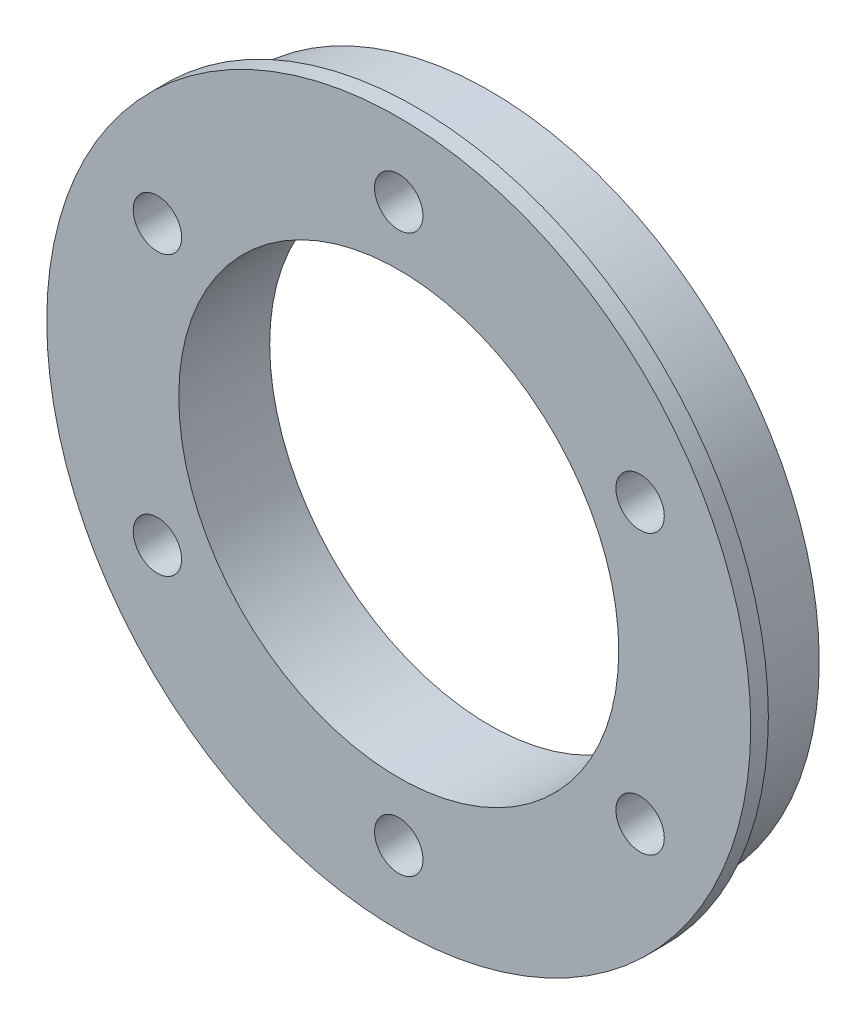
ISO-10303-21;
HEADER;
FILE_DESCRIPTION(('STEP AP214'),'2;1');
FILE_NAME('part.step','',(''),(''),'','','');
FILE_SCHEMA(('AUTOMOTIVE_DESIGN { 1 0 10303 214 1 1 1 1 }'));
ENDSEC;
DATA;
#1=APPLICATION_CONTEXT('core data for automotive mechanical design processes');
#2=APPLICATION_PROTOCOL_DEFINITION('international standard','automotive_design',2000,#1);
#3=PRODUCT_CONTEXT('',#1,'mechanical');
#4=PRODUCT('Part','Part','',(#3));
#5=PRODUCT_RELATED_PRODUCT_CATEGORY('part','',(#4));
#6=PRODUCT_DEFINITION_FORMATION('','',#4);
#7=PRODUCT_DEFINITION_CONTEXT('part definition',#1,'design');
#8=PRODUCT_DEFINITION('design','',#6,#7);
#9=PRODUCT_DEFINITION_SHAPE('','',#8);
#10=(LENGTH_UNIT() NAMED_UNIT(*) SI_UNIT(.MILLI.,.METRE.));
#11=(NAMED_UNIT(*) PLANE_ANGLE_UNIT() SI_UNIT($,.RADIAN.));
#12=(NAMED_UNIT(*) SI_UNIT($,.STERADIAN.) SOLID_ANGLE_UNIT());
#13=UNCERTAINTY_MEASURE_WITH_UNIT(LENGTH_MEASURE(1.E-05),#10,'distance_accuracy_value','');
#14=(GEOMETRIC_REPRESENTATION_CONTEXT(3) GLOBAL_UNCERTAINTY_ASSIGNED_CONTEXT((#13)) GLOBAL_UNIT_ASSIGNED_CONTEXT((#10,
#11,#12)) REPRESENTATION_CONTEXT('',''));
#15=CARTESIAN_POINT('',(0.,0.,0.));
#16=DIRECTION('',(0.,0.,1.));
#17=DIRECTION('',(1.,0.,0.));
#18=AXIS2_PLACEMENT_3D('',#15,#16,#17);
#19=CARTESIAN_POINT('',(0.,0.,5.));
#20=DIRECTION('',(0.,0.,1.));
#21=DIRECTION('',(1.,0.,0.));
#22=AXIS2_PLACEMENT_3D('',#19,#20,#21);
#23=PLANE('',#22);
#24=CARTESIAN_POINT('',(0.,0.,5.));
#25=DIRECTION('',(0.,0.,1.));
#26=DIRECTION('',(1.,0.,0.));
#27=AXIS2_PLACEMENT_3D('',#24,#25,#26);
#28=CIRCLE('',#27,22.47);
#29=CARTESIAN_POINT('',(22.47,0.,5.));
#30=VERTEX_POINT('',#29);
#31=EDGE_CURVE('E22',#30,#30,#28,.T.);
#32=ORIENTED_EDGE('',*,*,#31,.T.);
#33=EDGE_LOOP('',(#32));
#34=FACE_BOUND('',#33,.T.);
#35=CARTESIAN_POINT('',(0.,0.,5.));
#36=DIRECTION('',(0.,0.,1.));
#37=DIRECTION('',(1.,0.,0.));
#38=AXIS2_PLACEMENT_3D('',#35,#36,#37);
#39=CIRCLE('',#38,24.);
#40=CARTESIAN_POINT('',(24.,0.,5.));
#41=VERTEX_POINT('',#40);
#42=EDGE_CURVE('E41',#41,#41,#39,.T.);
#43=ORIENTED_EDGE('',*,*,#42,.F.);
#44=EDGE_LOOP('',(#43));
#45=FACE_BOUND('',#44,.T.);
#46=ADVANCED_FACE('F15',(#34,#45),#23,.F.);
#47=CARTESIAN_POINT('',(0.,0.,6.2));
#48=DIRECTION('',(0.,0.,1.));
#49=DIRECTION('',(1.,0.,0.));
#50=AXIS2_PLACEMENT_3D('',#47,#48,#49);
#51=PLANE('',#50);
#52=CARTESIAN_POINT('',(0.,0.,6.2));
#53=DIRECTION('',(0.,0.,1.));
#54=DIRECTION('',(1.,0.,0.));
#55=AXIS2_PLACEMENT_3D('',#52,#53,#54);
#56=CIRCLE('',#55,15.);
#57=CARTESIAN_POINT('',(15.,0.,6.2));
#58=VERTEX_POINT('',#57);
#59=EDGE_CURVE('E38',#58,#58,#56,.T.);
#60=ORIENTED_EDGE('',*,*,#59,.F.);
#61=EDGE_LOOP('',(#60));
#62=FACE_BOUND('',#61,.T.);
#63=CARTESIAN_POINT('',(-16.4544826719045,9.49999999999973,6.2));
#64=DIRECTION('',(0.,0.,1.));
#65=DIRECTION('',(1.,0.,0.));
#66=AXIS2_PLACEMENT_3D('',#63,#64,#65);
#67=CIRCLE('',#66,1.65);
#68=CARTESIAN_POINT('',(-14.8044826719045,9.49999999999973,6.2));
#69=VERTEX_POINT('',#68);
#70=EDGE_CURVE('E53',#69,#69,#67,.T.);
#71=ORIENTED_EDGE('',*,*,#70,.F.);
#72=EDGE_LOOP('',(#71));
#73=FACE_BOUND('',#72,.T.);
#74=CARTESIAN_POINT('',(-16.4544826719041,-9.50000000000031,6.2));
#75=DIRECTION('',(0.,0.,1.));
#76=DIRECTION('',(1.,0.,0.));
#77=AXIS2_PLACEMENT_3D('',#74,#75,#76);
#78=CIRCLE('',#77,1.65);
#79=CARTESIAN_POINT('',(-14.8044826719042,-9.50000000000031,6.2));
#80=VERTEX_POINT('',#79);
#81=EDGE_CURVE('E58',#80,#80,#78,.T.);
#82=ORIENTED_EDGE('',*,*,#81,.F.);
#83=EDGE_LOOP('',(#82));
#84=FACE_BOUND('',#83,.T.);
#85=CARTESIAN_POINT('',(1.32676290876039E-13,-19.,6.2));
#86=DIRECTION('',(0.,0.,1.));
#87=DIRECTION('',(1.,0.,0.));
#88=AXIS2_PLACEMENT_3D('',#85,#86,#87);
#89=CIRCLE('',#88,1.65);
#90=CARTESIAN_POINT('',(1.65000000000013,-19.,6.2));
#91=VERTEX_POINT('',#90);
#92=EDGE_CURVE('E69',#91,#91,#89,.T.);
#93=ORIENTED_EDGE('',*,*,#92,.F.);
#94=EDGE_LOOP('',(#93));
#95=FACE_BOUND('',#94,.T.);
#96=CARTESIAN_POINT('',(16.4544826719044,-9.49999999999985,6.2));
#97=DIRECTION('',(0.,0.,1.));
#98=DIRECTION('',(1.,0.,0.));
#99=AXIS2_PLACEMENT_3D('',#96,#97,#98);
#100=CIRCLE('',#99,1.65);
#101=CARTESIAN_POINT('',(18.1044826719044,-9.49999999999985,6.2));
#102=VERTEX_POINT('',#101);
#103=EDGE_CURVE('E70',#102,#102,#100,.T.);
#104=ORIENTED_EDGE('',*,*,#103,.F.);
#105=EDGE_LOOP('',(#104));
#106=FACE_BOUND('',#105,.T.);
#107=CARTESIAN_POINT('',(16.4544826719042,9.50000000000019,6.2));
#108=DIRECTION('',(0.,0.,1.));
#109=DIRECTION('',(1.,0.,0.));
#110=AXIS2_PLACEMENT_3D('',#107,#108,#109);
#111=CIRCLE('',#110,1.65);
#112=CARTESIAN_POINT('',(18.1044826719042,9.50000000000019,6.2));
#113=VERTEX_POINT('',#112);
#114=EDGE_CURVE('E79',#113,#113,#111,.T.);
#115=ORIENTED_EDGE('',*,*,#114,.F.);
#116=EDGE_LOOP('',(#115));
#117=FACE_BOUND('',#116,.T.);
#118=CARTESIAN_POINT('',(0.,19.,6.2));
#119=DIRECTION('',(0.,0.,1.));
#120=DIRECTION('',(1.,0.,0.));
#121=AXIS2_PLACEMENT_3D('',#118,#119,#120);
#122=CIRCLE('',#121,1.65);
#123=CARTESIAN_POINT('',(1.65,19.,6.2));
#124=VERTEX_POINT('',#123);
#125=EDGE_CURVE('E90',#124,#124,#122,.T.);
#126=ORIENTED_EDGE('',*,*,#125,.F.);
#127=EDGE_LOOP('',(#126));
#128=FACE_BOUND('',#127,.T.);
#129=CARTESIAN_POINT('',(0.,0.,6.2));
#130=DIRECTION('',(0.,0.,1.));
#131=DIRECTION('',(1.,0.,0.));
#132=AXIS2_PLACEMENT_3D('',#129,#130,#131);
#133=CIRCLE('',#132,24.);
#134=CARTESIAN_POINT('',(24.,0.,6.2));
#135=VERTEX_POINT('',#134);
#136=EDGE_CURVE('E45',#135,#135,#133,.T.);
#137=ORIENTED_EDGE('',*,*,#136,.T.);
#138=EDGE_LOOP('',(#137));
#139=FACE_BOUND('',#138,.T.);
#140=ADVANCED_FACE('F105',(#62,#73,#84,#95,#106,#117,#128,#139),#51,.T.);
#141=CARTESIAN_POINT('',(0.,0.,0.));
#142=DIRECTION('',(0.,0.,1.));
#143=DIRECTION('',(1.,0.,0.));
#144=AXIS2_PLACEMENT_3D('',#141,#142,#143);
#145=PLANE('',#144);
#146=CARTESIAN_POINT('',(0.,0.,0.));
#147=DIRECTION('',(0.,0.,1.));
#148=DIRECTION('',(1.,0.,0.));
#149=AXIS2_PLACEMENT_3D('',#146,#147,#148);
#150=CIRCLE('',#149,15.);
#151=CARTESIAN_POINT('',(15.,0.,0.));
#152=VERTEX_POINT('',#151);
#153=EDGE_CURVE('E31',#152,#152,#150,.T.);
#154=ORIENTED_EDGE('',*,*,#153,.T.);
#155=EDGE_LOOP('',(#154));
#156=FACE_BOUND('',#155,.T.);
#157=CARTESIAN_POINT('',(-16.4544826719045,9.49999999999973,0.));
#158=DIRECTION('',(0.,0.,-1.));
#159=DIRECTION('',(-1.,0.,0.));
#160=AXIS2_PLACEMENT_3D('',#157,#158,#159);
#161=CIRCLE('',#160,1.65);
#162=CARTESIAN_POINT('',(-18.1044826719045,9.49999999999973,0.));
#163=VERTEX_POINT('',#162);
#164=EDGE_CURVE('E49',#163,#163,#161,.T.);
#165=ORIENTED_EDGE('',*,*,#164,.F.);
#166=EDGE_LOOP('',(#165));
#167=FACE_BOUND('',#166,.T.);
#168=CARTESIAN_POINT('',(-16.4544826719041,-9.50000000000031,0.));
#169=DIRECTION('',(0.,0.,-1.));
#170=DIRECTION('',(-1.,0.,0.));
#171=AXIS2_PLACEMENT_3D('',#168,#169,#170);
#172=CIRCLE('',#171,1.65);
#173=CARTESIAN_POINT('',(-18.1044826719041,-9.50000000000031,0.));
#174=VERTEX_POINT('',#173);
#175=EDGE_CURVE('E57',#174,#174,#172,.T.);
#176=ORIENTED_EDGE('',*,*,#175,.F.);
#177=EDGE_LOOP('',(#176));
#178=FACE_BOUND('',#177,.T.);
#179=CARTESIAN_POINT('',(1.32676290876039E-13,-19.,0.));
#180=DIRECTION('',(0.,0.,-1.));
#181=DIRECTION('',(-1.,0.,0.));
#182=AXIS2_PLACEMENT_3D('',#179,#180,#181);
#183=CIRCLE('',#182,1.65);
#184=CARTESIAN_POINT('',(-1.64999999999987,-19.,0.));
#185=VERTEX_POINT('',#184);
#186=EDGE_CURVE('E62',#185,#185,#183,.T.);
#187=ORIENTED_EDGE('',*,*,#186,.F.);
#188=EDGE_LOOP('',(#187));
#189=FACE_BOUND('',#188,.T.);
#190=CARTESIAN_POINT('',(16.4544826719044,-9.49999999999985,0.));
#191=DIRECTION('',(0.,0.,-1.));
#192=DIRECTION('',(-1.,0.,0.));
#193=AXIS2_PLACEMENT_3D('',#190,#191,#192);
#194=CIRCLE('',#193,1.65);
#195=CARTESIAN_POINT('',(14.8044826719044,-9.49999999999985,0.));
#196=VERTEX_POINT('',#195);
#197=EDGE_CURVE('E74',#196,#196,#194,.T.);
#198=ORIENTED_EDGE('',*,*,#197,.F.);
#199=EDGE_LOOP('',(#198));
#200=FACE_BOUND('',#199,.T.);
#201=CARTESIAN_POINT('',(16.4544826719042,9.50000000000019,0.));
#202=DIRECTION('',(0.,0.,-1.));
#203=DIRECTION('',(-1.,0.,0.));
#204=AXIS2_PLACEMENT_3D('',#201,#202,#203);
#205=CIRCLE('',#204,1.65);
#206=CARTESIAN_POINT('',(14.8044826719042,9.50000000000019,0.));
#207=VERTEX_POINT('',#206);
#208=EDGE_CURVE('E75',#207,#207,#205,.T.);
#209=ORIENTED_EDGE('',*,*,#208,.F.);
#210=EDGE_LOOP('',(#209));
#211=FACE_BOUND('',#210,.T.);
#212=CARTESIAN_POINT('',(0.,19.,0.));
#213=DIRECTION('',(0.,0.,-1.));
#214=DIRECTION('',(-1.,0.,0.));
#215=AXIS2_PLACEMENT_3D('',#212,#213,#214);
#216=CIRCLE('',#215,1.65);
#217=CARTESIAN_POINT('',(-1.65,19.,0.));
#218=VERTEX_POINT('',#217);
#219=EDGE_CURVE('E86',#218,#218,#216,.T.);
#220=ORIENTED_EDGE('',*,*,#219,.F.);
#221=EDGE_LOOP('',(#220));
#222=FACE_BOUND('',#221,.T.);
#223=CARTESIAN_POINT('',(0.,0.,0.));
#224=DIRECTION('',(0.,0.,1.));
#225=DIRECTION('',(1.,0.,0.));
#226=AXIS2_PLACEMENT_3D('',#223,#224,#225);
#227=CIRCLE('',#226,22.47);
#228=CARTESIAN_POINT('',(22.47,0.,0.));
#229=VERTEX_POINT('',#228);
#230=EDGE_CURVE('E10',#229,#229,#227,.T.);
#231=ORIENTED_EDGE('',*,*,#230,.F.);
#232=EDGE_LOOP('',(#231));
#233=FACE_BOUND('',#232,.T.);
#234=ADVANCED_FACE('F108',(#156,#167,#178,#189,#200,#211,#222,#233),#145,.F.);
#235=CARTESIAN_POINT('',(0.,0.,5.));
#236=DIRECTION('',(0.,0.,-1.));
#237=DIRECTION('',(-1.,0.,0.));
#238=AXIS2_PLACEMENT_3D('',#235,#236,#237);
#239=CYLINDRICAL_SURFACE('',#238,22.47);
#240=ORIENTED_EDGE('',*,*,#230,.T.);
#241=EDGE_LOOP('',(#240));
#242=FACE_BOUND('',#241,.T.);
#243=ORIENTED_EDGE('',*,*,#31,.F.);
#244=EDGE_LOOP('',(#243));
#245=FACE_BOUND('',#244,.T.);
#246=ADVANCED_FACE('F128',(#242,#245),#239,.T.);
#247=CARTESIAN_POINT('',(0.,0.,5.));
#248=DIRECTION('',(0.,0.,-1.));
#249=DIRECTION('',(-1.,0.,0.));
#250=AXIS2_PLACEMENT_3D('',#247,#248,#249);
#251=CYLINDRICAL_SURFACE('',#250,15.);
#252=ORIENTED_EDGE('',*,*,#153,.F.);
#253=EDGE_LOOP('',(#252));
#254=FACE_BOUND('',#253,.T.);
#255=ORIENTED_EDGE('',*,*,#59,.T.);
#256=EDGE_LOOP('',(#255));
#257=FACE_BOUND('',#256,.T.);
#258=ADVANCED_FACE('F117',(#254,#257),#251,.F.);
#259=CARTESIAN_POINT('',(0.,0.,6.2));
#260=DIRECTION('',(0.,0.,-1.));
#261=DIRECTION('',(-1.,0.,0.));
#262=AXIS2_PLACEMENT_3D('',#259,#260,#261);
#263=CYLINDRICAL_SURFACE('',#262,24.);
#264=ORIENTED_EDGE('',*,*,#42,.T.);
#265=EDGE_LOOP('',(#264));
#266=FACE_BOUND('',#265,.T.);
#267=ORIENTED_EDGE('',*,*,#136,.F.);
#268=EDGE_LOOP('',(#267));
#269=FACE_BOUND('',#268,.T.);
#270=ADVANCED_FACE('F114',(#266,#269),#263,.T.);
#271=CARTESIAN_POINT('',(-16.4544826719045,9.49999999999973,10.));
#272=DIRECTION('',(0.,0.,-1.));
#273=DIRECTION('',(-1.,0.,0.));
#274=AXIS2_PLACEMENT_3D('',#271,#272,#273);
#275=CYLINDRICAL_SURFACE('',#274,1.65);
#276=ORIENTED_EDGE('',*,*,#164,.T.);
#277=EDGE_LOOP('',(#276));
#278=FACE_BOUND('',#277,.T.);
#279=ORIENTED_EDGE('',*,*,#70,.T.);
#280=EDGE_LOOP('',(#279));
#281=FACE_BOUND('',#280,.T.);
#282=ADVANCED_FACE('F116',(#278,#281),#275,.F.);
#283=CARTESIAN_POINT('',(-16.4544826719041,-9.50000000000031,10.));
#284=DIRECTION('',(0.,0.,-1.));
#285=DIRECTION('',(-1.,0.,0.));
#286=AXIS2_PLACEMENT_3D('',#283,#284,#285);
#287=CYLINDRICAL_SURFACE('',#286,1.65);
#288=ORIENTED_EDGE('',*,*,#175,.T.);
#289=EDGE_LOOP('',(#288));
#290=FACE_BOUND('',#289,.T.);
#291=ORIENTED_EDGE('',*,*,#81,.T.);
#292=EDGE_LOOP('',(#291));
#293=FACE_BOUND('',#292,.T.);
#294=ADVANCED_FACE('F125',(#290,#293),#287,.F.);
#295=CARTESIAN_POINT('',(1.32676290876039E-13,-19.,10.));
#296=DIRECTION('',(0.,0.,-1.));
#297=DIRECTION('',(-1.,0.,0.));
#298=AXIS2_PLACEMENT_3D('',#295,#296,#297);
#299=CYLINDRICAL_SURFACE('',#298,1.65);
#300=ORIENTED_EDGE('',*,*,#186,.T.);
#301=EDGE_LOOP('',(#300));
#302=FACE_BOUND('',#301,.T.);
#303=ORIENTED_EDGE('',*,*,#92,.T.);
#304=EDGE_LOOP('',(#303));
#305=FACE_BOUND('',#304,.T.);
#306=ADVANCED_FACE('F189',(#302,#305),#299,.F.);
#307=CARTESIAN_POINT('',(16.4544826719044,-9.49999999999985,10.));
#308=DIRECTION('',(0.,0.,-1.));
#309=DIRECTION('',(-1.,0.,0.));
#310=AXIS2_PLACEMENT_3D('',#307,#308,#309);
#311=CYLINDRICAL_SURFACE('',#310,1.65);
#312=ORIENTED_EDGE('',*,*,#197,.T.);
#313=EDGE_LOOP('',(#312));
#314=FACE_BOUND('',#313,.T.);
#315=ORIENTED_EDGE('',*,*,#103,.T.);
#316=EDGE_LOOP('',(#315));
#317=FACE_BOUND('',#316,.T.);
#318=ADVANCED_FACE('F200',(#314,#317),#311,.F.);
#319=CARTESIAN_POINT('',(16.4544826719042,9.50000000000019,10.));
#320=DIRECTION('',(0.,0.,-1.));
#321=DIRECTION('',(-1.,0.,0.));
#322=AXIS2_PLACEMENT_3D('',#319,#320,#321);
#323=CYLINDRICAL_SURFACE('',#322,1.65);
#324=ORIENTED_EDGE('',*,*,#208,.T.);
#325=EDGE_LOOP('',(#324));
#326=FACE_BOUND('',#325,.T.);
#327=ORIENTED_EDGE('',*,*,#114,.T.);
#328=EDGE_LOOP('',(#327));
#329=FACE_BOUND('',#328,.T.);
#330=ADVANCED_FACE('F103',(#326,#329),#323,.F.);
#331=CARTESIAN_POINT('',(0.,19.,10.));
#332=DIRECTION('',(0.,0.,-1.));
#333=DIRECTION('',(-1.,0.,0.));
#334=AXIS2_PLACEMENT_3D('',#331,#332,#333);
#335=CYLINDRICAL_SURFACE('',#334,1.65);
#336=ORIENTED_EDGE('',*,*,#219,.T.);
#337=EDGE_LOOP('',(#336));
#338=FACE_BOUND('',#337,.T.);
#339=ORIENTED_EDGE('',*,*,#125,.T.);
#340=EDGE_LOOP('',(#339));
#341=FACE_BOUND('',#340,.T.);
#342=ADVANCED_FACE('F221',(#338,#341),#335,.F.);
#343=CLOSED_SHELL('',(#46,#140,#234,#246,#258,#270,#282,#294,#306,#318,#330,#342));
#344=MANIFOLD_SOLID_BREP('B1',#343);
#345=ADVANCED_BREP_SHAPE_REPRESENTATION('',(#18,#344),#14);
#346=SHAPE_DEFINITION_REPRESENTATION(#9,#345);
ENDSEC;
END-ISO-10303-21;
